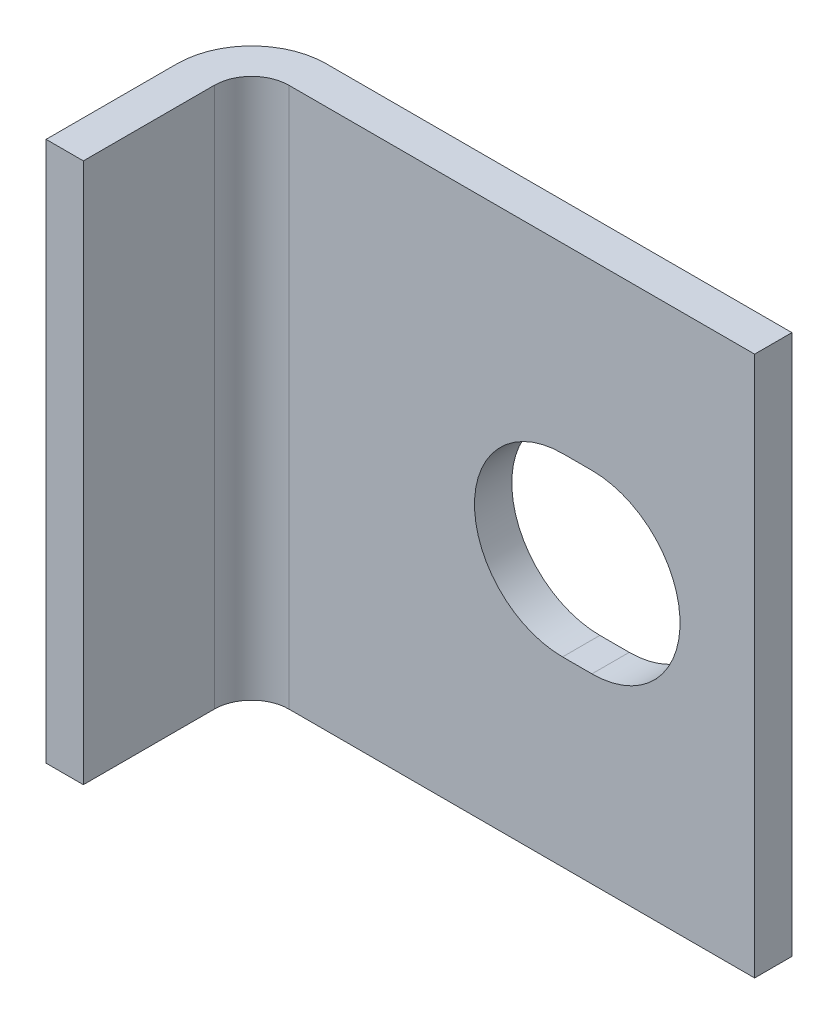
ISO-10303-21;
HEADER;
FILE_DESCRIPTION(('STEP AP214'),'2;1');
FILE_NAME('part.step','',(''),(''),'','','');
FILE_SCHEMA(('AUTOMOTIVE_DESIGN { 1 0 10303 214 1 1 1 1 }'));
ENDSEC;
DATA;
#1=APPLICATION_CONTEXT('core data for automotive mechanical design processes');
#2=APPLICATION_PROTOCOL_DEFINITION('international standard','automotive_design',2000,#1);
#3=PRODUCT_CONTEXT('',#1,'mechanical');
#4=PRODUCT('Part','Part','',(#3));
#5=PRODUCT_RELATED_PRODUCT_CATEGORY('part','',(#4));
#6=PRODUCT_DEFINITION_FORMATION('','',#4);
#7=PRODUCT_DEFINITION_CONTEXT('part definition',#1,'design');
#8=PRODUCT_DEFINITION('design','',#6,#7);
#9=PRODUCT_DEFINITION_SHAPE('','',#8);
#10=(LENGTH_UNIT() NAMED_UNIT(*) SI_UNIT(.MILLI.,.METRE.));
#11=(NAMED_UNIT(*) PLANE_ANGLE_UNIT() SI_UNIT($,.RADIAN.));
#12=(NAMED_UNIT(*) SI_UNIT($,.STERADIAN.) SOLID_ANGLE_UNIT());
#13=UNCERTAINTY_MEASURE_WITH_UNIT(LENGTH_MEASURE(1.E-05),#10,'distance_accuracy_value','');
#14=(GEOMETRIC_REPRESENTATION_CONTEXT(3) GLOBAL_UNCERTAINTY_ASSIGNED_CONTEXT((#13)) GLOBAL_UNIT_ASSIGNED_CONTEXT((#10,
#11,#12)) REPRESENTATION_CONTEXT('',''));
#15=CARTESIAN_POINT('',(0.,0.,0.));
#16=DIRECTION('',(0.,0.,1.));
#17=DIRECTION('',(1.,0.,0.));
#18=AXIS2_PLACEMENT_3D('',#15,#16,#17);
#19=CARTESIAN_POINT('',(-4.91,4.6,1.27));
#20=DIRECTION('',(0.,-1.,0.));
#21=DIRECTION('',(0.,0.,-1.));
#22=AXIS2_PLACEMENT_3D('',#19,#20,#21);
#23=CYLINDRICAL_SURFACE('',#22,1.27);
#24=CARTESIAN_POINT('',(-4.91,-4.6,1.27));
#25=DIRECTION('',(0.,1.,0.));
#26=DIRECTION('',(0.,0.,-1.));
#27=AXIS2_PLACEMENT_3D('',#24,#25,#26);
#28=CIRCLE('',#27,1.27);
#29=CARTESIAN_POINT('',(-4.91,-4.6,0.));
#30=VERTEX_POINT('',#29);
#31=CARTESIAN_POINT('',(-6.18,-4.6,1.27));
#32=VERTEX_POINT('',#31);
#33=EDGE_CURVE('E136',#30,#32,#28,.T.);
#34=ORIENTED_EDGE('',*,*,#33,.T.);
#35=DIRECTION('',(0.,-1.,0.));
#36=VECTOR('',#35,1.);
#37=CARTESIAN_POINT('',(-6.18,4.6,1.27));
#38=LINE('',#37,#36);
#39=CARTESIAN_POINT('',(-6.18,4.6,1.27));
#40=VERTEX_POINT('',#39);
#41=EDGE_CURVE('E9',#40,#32,#38,.T.);
#42=ORIENTED_EDGE('',*,*,#41,.F.);
#43=CARTESIAN_POINT('',(-4.91,4.6,1.27));
#44=DIRECTION('',(0.,1.,0.));
#45=DIRECTION('',(0.,0.,-1.));
#46=AXIS2_PLACEMENT_3D('',#43,#44,#45);
#47=CIRCLE('',#46,1.27);
#48=CARTESIAN_POINT('',(-4.91,4.6,0.));
#49=VERTEX_POINT('',#48);
#50=EDGE_CURVE('E140',#49,#40,#47,.T.);
#51=ORIENTED_EDGE('',*,*,#50,.F.);
#52=DIRECTION('',(0.,-1.,0.));
#53=VECTOR('',#52,1.);
#54=CARTESIAN_POINT('',(-4.91,4.6,0.));
#55=LINE('',#54,#53);
#56=EDGE_CURVE('E158',#49,#30,#55,.T.);
#57=ORIENTED_EDGE('',*,*,#56,.T.);
#58=EDGE_LOOP('',(#34,#42,#51,#57));
#59=FACE_BOUND('',#58,.T.);
#60=ADVANCED_FACE('F15',(#59),#23,.T.);
#61=CARTESIAN_POINT('',(-6.18,4.6,1.27));
#62=DIRECTION('',(1.,0.,0.));
#63=DIRECTION('',(0.,0.,-1.));
#64=AXIS2_PLACEMENT_3D('',#61,#62,#63);
#65=PLANE('',#64);
#66=DIRECTION('',(0.,0.,1.));
#67=VECTOR('',#66,1.);
#68=CARTESIAN_POINT('',(-6.18,-4.6,1.27));
#69=LINE('',#68,#67);
#70=CARTESIAN_POINT('',(-6.18,-4.6,3.5));
#71=VERTEX_POINT('',#70);
#72=EDGE_CURVE('E161',#32,#71,#69,.T.);
#73=ORIENTED_EDGE('',*,*,#72,.T.);
#74=DIRECTION('',(0.,-1.,0.));
#75=VECTOR('',#74,1.);
#76=CARTESIAN_POINT('',(-6.18,4.6,3.5));
#77=LINE('',#76,#75);
#78=CARTESIAN_POINT('',(-6.18,4.6,3.5));
#79=VERTEX_POINT('',#78);
#80=EDGE_CURVE('E22',#79,#71,#77,.T.);
#81=ORIENTED_EDGE('',*,*,#80,.F.);
#82=DIRECTION('',(0.,0.,1.));
#83=VECTOR('',#82,1.);
#84=CARTESIAN_POINT('',(-6.18,4.6,1.27));
#85=LINE('',#84,#83);
#86=EDGE_CURVE('E143',#40,#79,#85,.T.);
#87=ORIENTED_EDGE('',*,*,#86,.F.);
#88=ORIENTED_EDGE('',*,*,#41,.T.);
#89=EDGE_LOOP('',(#73,#81,#87,#88));
#90=FACE_BOUND('',#89,.T.);
#91=ADVANCED_FACE('F218',(#90),#65,.F.);
#92=CARTESIAN_POINT('',(-6.18,4.6,3.5));
#93=DIRECTION('',(0.,0.,-1.));
#94=DIRECTION('',(-1.,0.,0.));
#95=AXIS2_PLACEMENT_3D('',#92,#93,#94);
#96=PLANE('',#95);
#97=DIRECTION('',(1.,0.,0.));
#98=VECTOR('',#97,1.);
#99=CARTESIAN_POINT('',(-6.18,-4.6,3.5));
#100=LINE('',#99,#98);
#101=CARTESIAN_POINT('',(-5.545,-4.6,3.5));
#102=VERTEX_POINT('',#101);
#103=EDGE_CURVE('E163',#71,#102,#100,.T.);
#104=ORIENTED_EDGE('',*,*,#103,.T.);
#105=DIRECTION('',(0.,-1.,0.));
#106=VECTOR('',#105,1.);
#107=CARTESIAN_POINT('',(-5.545,4.6,3.5));
#108=LINE('',#107,#106);
#109=CARTESIAN_POINT('',(-5.545,4.6,3.5));
#110=VERTEX_POINT('',#109);
#111=EDGE_CURVE('E188',#110,#102,#108,.T.);
#112=ORIENTED_EDGE('',*,*,#111,.F.);
#113=DIRECTION('',(1.,0.,0.));
#114=VECTOR('',#113,1.);
#115=CARTESIAN_POINT('',(-6.18,4.6,3.5));
#116=LINE('',#115,#114);
#117=EDGE_CURVE('E146',#79,#110,#116,.T.);
#118=ORIENTED_EDGE('',*,*,#117,.F.);
#119=ORIENTED_EDGE('',*,*,#80,.T.);
#120=EDGE_LOOP('',(#104,#112,#118,#119));
#121=FACE_BOUND('',#120,.T.);
#122=ADVANCED_FACE('F195',(#121),#96,.F.);
#123=CARTESIAN_POINT('',(-5.545,4.6,1.27));
#124=DIRECTION('',(-1.,0.,0.));
#125=DIRECTION('',(0.,0.,1.));
#126=AXIS2_PLACEMENT_3D('',#123,#124,#125);
#127=PLANE('',#126);
#128=DIRECTION('',(0.,0.,-1.));
#129=VECTOR('',#128,1.);
#130=CARTESIAN_POINT('',(-5.545,-4.6,1.27));
#131=LINE('',#130,#129);
#132=CARTESIAN_POINT('',(-5.545,-4.6,1.27));
#133=VERTEX_POINT('',#132);
#134=EDGE_CURVE('E165',#102,#133,#131,.T.);
#135=ORIENTED_EDGE('',*,*,#134,.T.);
#136=DIRECTION('',(0.,-1.,0.));
#137=VECTOR('',#136,1.);
#138=CARTESIAN_POINT('',(-5.545,4.6,1.27));
#139=LINE('',#138,#137);
#140=CARTESIAN_POINT('',(-5.545,4.6,1.27));
#141=VERTEX_POINT('',#140);
#142=EDGE_CURVE('E185',#141,#133,#139,.T.);
#143=ORIENTED_EDGE('',*,*,#142,.F.);
#144=DIRECTION('',(0.,0.,-1.));
#145=VECTOR('',#144,1.);
#146=CARTESIAN_POINT('',(-5.545,4.6,1.27));
#147=LINE('',#146,#145);
#148=EDGE_CURVE('E148',#110,#141,#147,.T.);
#149=ORIENTED_EDGE('',*,*,#148,.F.);
#150=ORIENTED_EDGE('',*,*,#111,.T.);
#151=EDGE_LOOP('',(#135,#143,#149,#150));
#152=FACE_BOUND('',#151,.T.);
#153=ADVANCED_FACE('F206',(#152),#127,.F.);
#154=CARTESIAN_POINT('',(-4.91,4.6,1.27));
#155=DIRECTION('',(0.,-1.,0.));
#156=DIRECTION('',(0.,0.,-1.));
#157=AXIS2_PLACEMENT_3D('',#154,#155,#156);
#158=CYLINDRICAL_SURFACE('',#157,0.635);
#159=CARTESIAN_POINT('',(-4.91,-4.6,1.27));
#160=DIRECTION('',(0.,-1.,0.));
#161=DIRECTION('',(0.,0.,1.));
#162=AXIS2_PLACEMENT_3D('',#159,#160,#161);
#163=CIRCLE('',#162,0.635);
#164=CARTESIAN_POINT('',(-4.91,-4.6,0.635));
#165=VERTEX_POINT('',#164);
#166=EDGE_CURVE('E167',#133,#165,#163,.T.);
#167=ORIENTED_EDGE('',*,*,#166,.T.);
#168=DIRECTION('',(0.,-1.,0.));
#169=VECTOR('',#168,1.);
#170=CARTESIAN_POINT('',(-4.91,4.6,0.635));
#171=LINE('',#170,#169);
#172=CARTESIAN_POINT('',(-4.91,4.6,0.635));
#173=VERTEX_POINT('',#172);
#174=EDGE_CURVE('E182',#173,#165,#171,.T.);
#175=ORIENTED_EDGE('',*,*,#174,.F.);
#176=CARTESIAN_POINT('',(-4.91,4.6,1.27));
#177=DIRECTION('',(0.,-1.,0.));
#178=DIRECTION('',(0.,0.,1.));
#179=AXIS2_PLACEMENT_3D('',#176,#177,#178);
#180=CIRCLE('',#179,0.635);
#181=EDGE_CURVE('E150',#141,#173,#180,.T.);
#182=ORIENTED_EDGE('',*,*,#181,.F.);
#183=ORIENTED_EDGE('',*,*,#142,.T.);
#184=EDGE_LOOP('',(#167,#175,#182,#183));
#185=FACE_BOUND('',#184,.T.);
#186=ADVANCED_FACE('F210',(#185),#158,.F.);
#187=CARTESIAN_POINT('',(3.02,4.6,0.635));
#188=DIRECTION('',(0.,0.,-1.));
#189=DIRECTION('',(-1.,0.,0.));
#190=AXIS2_PLACEMENT_3D('',#187,#188,#189);
#191=PLANE('',#190);
#192=DIRECTION('',(-1.,0.,0.));
#193=VECTOR('',#192,1.);
#194=CARTESIAN_POINT('',(-0.25,-1.5,0.635));
#195=LINE('',#194,#193);
#196=CARTESIAN_POINT('',(0.25,-1.5,0.635));
#197=VERTEX_POINT('',#196);
#198=CARTESIAN_POINT('',(-0.25,-1.5,0.635));
#199=VERTEX_POINT('',#198);
#200=EDGE_CURVE('E111',#197,#199,#195,.T.);
#201=ORIENTED_EDGE('',*,*,#200,.T.);
#202=CARTESIAN_POINT('',(-0.25,0.,0.635));
#203=DIRECTION('',(0.,0.,-1.));
#204=DIRECTION('',(-1.,0.,0.));
#205=AXIS2_PLACEMENT_3D('',#202,#203,#204);
#206=CIRCLE('',#205,1.5);
#207=CARTESIAN_POINT('',(-0.25,1.5,0.635));
#208=VERTEX_POINT('',#207);
#209=EDGE_CURVE('E105',#199,#208,#206,.T.);
#210=ORIENTED_EDGE('',*,*,#209,.T.);
#211=DIRECTION('',(1.,0.,0.));
#212=VECTOR('',#211,1.);
#213=CARTESIAN_POINT('',(-0.25,1.5,0.635));
#214=LINE('',#213,#212);
#215=CARTESIAN_POINT('',(0.25,1.5,0.635));
#216=VERTEX_POINT('',#215);
#217=EDGE_CURVE('E114',#208,#216,#214,.T.);
#218=ORIENTED_EDGE('',*,*,#217,.T.);
#219=CARTESIAN_POINT('',(0.25,0.,0.635));
#220=DIRECTION('',(0.,0.,-1.));
#221=DIRECTION('',(-1.,0.,0.));
#222=AXIS2_PLACEMENT_3D('',#219,#220,#221);
#223=CIRCLE('',#222,1.5);
#224=EDGE_CURVE('E29',#216,#197,#223,.T.);
#225=ORIENTED_EDGE('',*,*,#224,.T.);
#226=EDGE_LOOP('',(#201,#210,#218,#225));
#227=FACE_BOUND('',#226,.T.);
#228=DIRECTION('',(1.,0.,0.));
#229=VECTOR('',#228,1.);
#230=CARTESIAN_POINT('',(3.02,-4.6,0.635));
#231=LINE('',#230,#229);
#232=CARTESIAN_POINT('',(3.02,-4.6,0.635));
#233=VERTEX_POINT('',#232);
#234=EDGE_CURVE('E169',#165,#233,#231,.T.);
#235=ORIENTED_EDGE('',*,*,#234,.T.);
#236=DIRECTION('',(0.,-1.,0.));
#237=VECTOR('',#236,1.);
#238=CARTESIAN_POINT('',(3.02,4.6,0.635));
#239=LINE('',#238,#237);
#240=CARTESIAN_POINT('',(3.02,4.6,0.635));
#241=VERTEX_POINT('',#240);
#242=EDGE_CURVE('E179',#241,#233,#239,.T.);
#243=ORIENTED_EDGE('',*,*,#242,.F.);
#244=DIRECTION('',(1.,0.,0.));
#245=VECTOR('',#244,1.);
#246=CARTESIAN_POINT('',(3.02,4.6,0.635));
#247=LINE('',#246,#245);
#248=EDGE_CURVE('E152',#173,#241,#247,.T.);
#249=ORIENTED_EDGE('',*,*,#248,.F.);
#250=ORIENTED_EDGE('',*,*,#174,.T.);
#251=EDGE_LOOP('',(#235,#243,#249,#250));
#252=FACE_BOUND('',#251,.T.);
#253=ADVANCED_FACE('F118',(#227,#252),#191,.F.);
#254=CARTESIAN_POINT('',(3.02,4.6,0.635));
#255=DIRECTION('',(-1.,0.,0.));
#256=DIRECTION('',(0.,0.,1.));
#257=AXIS2_PLACEMENT_3D('',#254,#255,#256);
#258=PLANE('',#257);
#259=DIRECTION('',(0.,0.,-1.));
#260=VECTOR('',#259,1.);
#261=CARTESIAN_POINT('',(3.02,-4.6,0.635));
#262=LINE('',#261,#260);
#263=CARTESIAN_POINT('',(3.02,-4.6,0.));
#264=VERTEX_POINT('',#263);
#265=EDGE_CURVE('E171',#233,#264,#262,.T.);
#266=ORIENTED_EDGE('',*,*,#265,.T.);
#267=DIRECTION('',(0.,-1.,0.));
#268=VECTOR('',#267,1.);
#269=CARTESIAN_POINT('',(3.02,4.6,0.));
#270=LINE('',#269,#268);
#271=CARTESIAN_POINT('',(3.02,4.6,0.));
#272=VERTEX_POINT('',#271);
#273=EDGE_CURVE('E176',#272,#264,#270,.T.);
#274=ORIENTED_EDGE('',*,*,#273,.F.);
#275=DIRECTION('',(0.,0.,-1.));
#276=VECTOR('',#275,1.);
#277=CARTESIAN_POINT('',(3.02,4.6,0.635));
#278=LINE('',#277,#276);
#279=EDGE_CURVE('E154',#241,#272,#278,.T.);
#280=ORIENTED_EDGE('',*,*,#279,.F.);
#281=ORIENTED_EDGE('',*,*,#242,.T.);
#282=EDGE_LOOP('',(#266,#274,#280,#281));
#283=FACE_BOUND('',#282,.T.);
#284=ADVANCED_FACE('F229',(#283),#258,.F.);
#285=CARTESIAN_POINT('',(3.02,4.6,0.));
#286=DIRECTION('',(0.,0.,1.));
#287=DIRECTION('',(1.,0.,0.));
#288=AXIS2_PLACEMENT_3D('',#285,#286,#287);
#289=PLANE('',#288);
#290=DIRECTION('',(1.,0.,0.));
#291=VECTOR('',#290,1.);
#292=CARTESIAN_POINT('',(-0.25,1.5,0.));
#293=LINE('',#292,#291);
#294=CARTESIAN_POINT('',(-0.25,1.5,0.));
#295=VERTEX_POINT('',#294);
#296=CARTESIAN_POINT('',(0.25,1.5,0.));
#297=VERTEX_POINT('',#296);
#298=EDGE_CURVE('E130',#295,#297,#293,.T.);
#299=ORIENTED_EDGE('',*,*,#298,.F.);
#300=CARTESIAN_POINT('',(-0.25,0.,0.));
#301=DIRECTION('',(0.,0.,-1.));
#302=DIRECTION('',(-1.,0.,0.));
#303=AXIS2_PLACEMENT_3D('',#300,#301,#302);
#304=CIRCLE('',#303,1.5);
#305=CARTESIAN_POINT('',(-0.25,-1.5,0.));
#306=VERTEX_POINT('',#305);
#307=EDGE_CURVE('E37',#306,#295,#304,.T.);
#308=ORIENTED_EDGE('',*,*,#307,.F.);
#309=DIRECTION('',(-1.,0.,0.));
#310=VECTOR('',#309,1.);
#311=CARTESIAN_POINT('',(-0.25,-1.5,0.));
#312=LINE('',#311,#310);
#313=CARTESIAN_POINT('',(0.25,-1.5,0.));
#314=VERTEX_POINT('',#313);
#315=EDGE_CURVE('E121',#314,#306,#312,.T.);
#316=ORIENTED_EDGE('',*,*,#315,.F.);
#317=CARTESIAN_POINT('',(0.25,0.,0.));
#318=DIRECTION('',(0.,0.,-1.));
#319=DIRECTION('',(-1.,0.,0.));
#320=AXIS2_PLACEMENT_3D('',#317,#318,#319);
#321=CIRCLE('',#320,1.5);
#322=EDGE_CURVE('E124',#297,#314,#321,.T.);
#323=ORIENTED_EDGE('',*,*,#322,.F.);
#324=EDGE_LOOP('',(#299,#308,#316,#323));
#325=FACE_BOUND('',#324,.T.);
#326=DIRECTION('',(-1.,0.,0.));
#327=VECTOR('',#326,1.);
#328=CARTESIAN_POINT('',(3.02,-4.6,0.));
#329=LINE('',#328,#327);
#330=EDGE_CURVE('E144',#264,#30,#329,.T.);
#331=ORIENTED_EDGE('',*,*,#330,.T.);
#332=ORIENTED_EDGE('',*,*,#56,.F.);
#333=DIRECTION('',(-1.,0.,0.));
#334=VECTOR('',#333,1.);
#335=CARTESIAN_POINT('',(3.02,4.6,0.));
#336=LINE('',#335,#334);
#337=EDGE_CURVE('E156',#272,#49,#336,.T.);
#338=ORIENTED_EDGE('',*,*,#337,.F.);
#339=ORIENTED_EDGE('',*,*,#273,.T.);
#340=EDGE_LOOP('',(#331,#332,#338,#339));
#341=FACE_BOUND('',#340,.T.);
#342=ADVANCED_FACE('F224',(#325,#341),#289,.F.);
#343=CARTESIAN_POINT('',(-4.91,4.6,1.27));
#344=DIRECTION('',(0.,-1.,0.));
#345=DIRECTION('',(0.,0.,-1.));
#346=AXIS2_PLACEMENT_3D('',#343,#344,#345);
#347=PLANE('',#346);
#348=ORIENTED_EDGE('',*,*,#50,.T.);
#349=ORIENTED_EDGE('',*,*,#86,.T.);
#350=ORIENTED_EDGE('',*,*,#117,.T.);
#351=ORIENTED_EDGE('',*,*,#148,.T.);
#352=ORIENTED_EDGE('',*,*,#181,.T.);
#353=ORIENTED_EDGE('',*,*,#248,.T.);
#354=ORIENTED_EDGE('',*,*,#279,.T.);
#355=ORIENTED_EDGE('',*,*,#337,.T.);
#356=EDGE_LOOP('',(#348,#349,#350,#351,#352,#353,#354,#355));
#357=FACE_BOUND('',#356,.T.);
#358=ADVANCED_FACE('F214',(#357),#347,.F.);
#359=CARTESIAN_POINT('',(-4.91,-4.6,1.27));
#360=DIRECTION('',(0.,-1.,0.));
#361=DIRECTION('',(0.,0.,-1.));
#362=AXIS2_PLACEMENT_3D('',#359,#360,#361);
#363=PLANE('',#362);
#364=ORIENTED_EDGE('',*,*,#33,.F.);
#365=ORIENTED_EDGE('',*,*,#330,.F.);
#366=ORIENTED_EDGE('',*,*,#265,.F.);
#367=ORIENTED_EDGE('',*,*,#234,.F.);
#368=ORIENTED_EDGE('',*,*,#166,.F.);
#369=ORIENTED_EDGE('',*,*,#134,.F.);
#370=ORIENTED_EDGE('',*,*,#103,.F.);
#371=ORIENTED_EDGE('',*,*,#72,.F.);
#372=EDGE_LOOP('',(#364,#365,#366,#367,#368,#369,#370,#371));
#373=FACE_BOUND('',#372,.T.);
#374=ADVANCED_FACE('F201',(#373),#363,.T.);
#375=CARTESIAN_POINT('',(-0.25,0.,0.635));
#376=DIRECTION('',(0.,0.,-1.));
#377=DIRECTION('',(-1.,0.,0.));
#378=AXIS2_PLACEMENT_3D('',#375,#376,#377);
#379=CYLINDRICAL_SURFACE('',#378,1.5);
#380=ORIENTED_EDGE('',*,*,#307,.T.);
#381=DIRECTION('',(0.,0.,-1.));
#382=VECTOR('',#381,1.);
#383=CARTESIAN_POINT('',(-0.25,1.5,0.635));
#384=LINE('',#383,#382);
#385=EDGE_CURVE('E101',#208,#295,#384,.T.);
#386=ORIENTED_EDGE('',*,*,#385,.F.);
#387=ORIENTED_EDGE('',*,*,#209,.F.);
#388=DIRECTION('',(0.,0.,-1.));
#389=VECTOR('',#388,1.);
#390=CARTESIAN_POINT('',(-0.25,-1.5,0.635));
#391=LINE('',#390,#389);
#392=EDGE_CURVE('E134',#199,#306,#391,.T.);
#393=ORIENTED_EDGE('',*,*,#392,.T.);
#394=EDGE_LOOP('',(#380,#386,#387,#393));
#395=FACE_BOUND('',#394,.T.);
#396=ADVANCED_FACE('F103',(#395),#379,.F.);
#397=CARTESIAN_POINT('',(-0.25,-1.5,0.635));
#398=DIRECTION('',(0.,-1.,0.));
#399=DIRECTION('',(0.,0.,-1.));
#400=AXIS2_PLACEMENT_3D('',#397,#398,#399);
#401=PLANE('',#400);
#402=ORIENTED_EDGE('',*,*,#315,.T.);
#403=ORIENTED_EDGE('',*,*,#392,.F.);
#404=ORIENTED_EDGE('',*,*,#200,.F.);
#405=DIRECTION('',(0.,0.,-1.));
#406=VECTOR('',#405,1.);
#407=CARTESIAN_POINT('',(0.25,-1.5,0.635));
#408=LINE('',#407,#406);
#409=EDGE_CURVE('E137',#197,#314,#408,.T.);
#410=ORIENTED_EDGE('',*,*,#409,.T.);
#411=EDGE_LOOP('',(#402,#403,#404,#410));
#412=FACE_BOUND('',#411,.T.);
#413=ADVANCED_FACE('F319',(#412),#401,.F.);
#414=CARTESIAN_POINT('',(0.25,0.,0.635));
#415=DIRECTION('',(0.,0.,-1.));
#416=DIRECTION('',(-1.,0.,0.));
#417=AXIS2_PLACEMENT_3D('',#414,#415,#416);
#418=CYLINDRICAL_SURFACE('',#417,1.5);
#419=ORIENTED_EDGE('',*,*,#322,.T.);
#420=ORIENTED_EDGE('',*,*,#409,.F.);
#421=ORIENTED_EDGE('',*,*,#224,.F.);
#422=DIRECTION('',(0.,0.,-1.));
#423=VECTOR('',#422,1.);
#424=CARTESIAN_POINT('',(0.25,1.5,0.635));
#425=LINE('',#424,#423);
#426=EDGE_CURVE('E110',#216,#297,#425,.T.);
#427=ORIENTED_EDGE('',*,*,#426,.T.);
#428=EDGE_LOOP('',(#419,#420,#421,#427));
#429=FACE_BOUND('',#428,.T.);
#430=ADVANCED_FACE('F327',(#429),#418,.F.);
#431=CARTESIAN_POINT('',(-0.25,1.5,0.635));
#432=DIRECTION('',(0.,1.,0.));
#433=DIRECTION('',(0.,0.,1.));
#434=AXIS2_PLACEMENT_3D('',#431,#432,#433);
#435=PLANE('',#434);
#436=ORIENTED_EDGE('',*,*,#298,.T.);
#437=ORIENTED_EDGE('',*,*,#426,.F.);
#438=ORIENTED_EDGE('',*,*,#217,.F.);
#439=ORIENTED_EDGE('',*,*,#385,.T.);
#440=EDGE_LOOP('',(#436,#437,#438,#439));
#441=FACE_BOUND('',#440,.T.);
#442=ADVANCED_FACE('F115',(#441),#435,.F.);
#443=CLOSED_SHELL('',(#60,#91,#122,#153,#186,#253,#284,#342,#358,#374,#396,#413,#430,#442));
#444=MANIFOLD_SOLID_BREP('B1',#443);
#445=ADVANCED_BREP_SHAPE_REPRESENTATION('',(#18,#444),#14);
#446=SHAPE_DEFINITION_REPRESENTATION(#9,#445);
ENDSEC;
END-ISO-10303-21;
